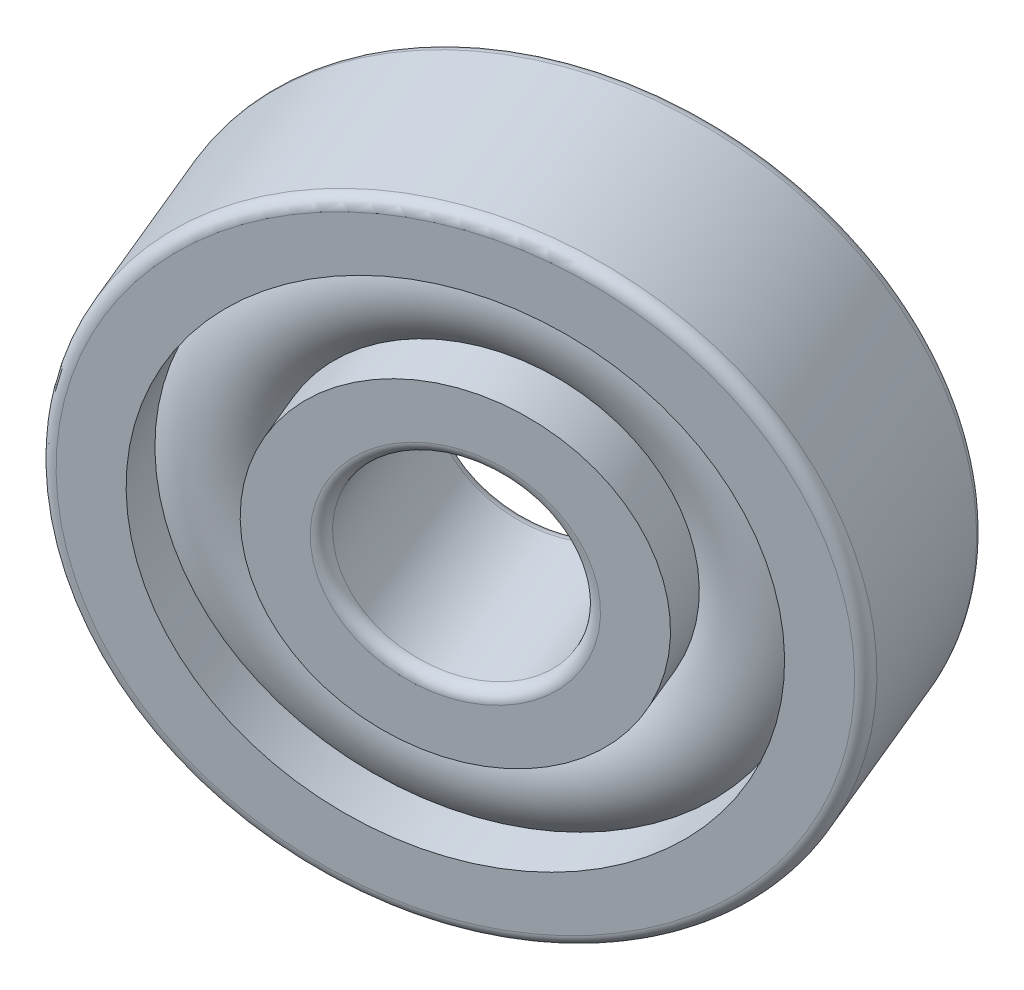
ISO-10303-21;
HEADER;
FILE_DESCRIPTION(('STEP AP214'),'2;1');
FILE_NAME('part.step','',(''),(''),'','','');
FILE_SCHEMA(('AUTOMOTIVE_DESIGN { 1 0 10303 214 1 1 1 1 }'));
ENDSEC;
DATA;
#1=APPLICATION_CONTEXT('core data for automotive mechanical design processes');
#2=APPLICATION_PROTOCOL_DEFINITION('international standard','automotive_design',2000,#1);
#3=PRODUCT_CONTEXT('',#1,'mechanical');
#4=PRODUCT('Part','Part','',(#3));
#5=PRODUCT_RELATED_PRODUCT_CATEGORY('part','',(#4));
#6=PRODUCT_DEFINITION_FORMATION('','',#4);
#7=PRODUCT_DEFINITION_CONTEXT('part definition',#1,'design');
#8=PRODUCT_DEFINITION('design','',#6,#7);
#9=PRODUCT_DEFINITION_SHAPE('','',#8);
#10=(LENGTH_UNIT() NAMED_UNIT(*) SI_UNIT(.MILLI.,.METRE.));
#11=(NAMED_UNIT(*) PLANE_ANGLE_UNIT() SI_UNIT($,.RADIAN.));
#12=(NAMED_UNIT(*) SI_UNIT($,.STERADIAN.) SOLID_ANGLE_UNIT());
#13=UNCERTAINTY_MEASURE_WITH_UNIT(LENGTH_MEASURE(1.E-05),#10,'distance_accuracy_value','');
#14=(GEOMETRIC_REPRESENTATION_CONTEXT(3) GLOBAL_UNCERTAINTY_ASSIGNED_CONTEXT((#13)) GLOBAL_UNIT_ASSIGNED_CONTEXT((#10,
#11,#12)) REPRESENTATION_CONTEXT('',''));
#15=CARTESIAN_POINT('',(0.,0.,0.));
#16=DIRECTION('',(0.,0.,1.));
#17=DIRECTION('',(1.,0.,0.));
#18=AXIS2_PLACEMENT_3D('',#15,#16,#17);
#19=CARTESIAN_POINT('',(40.2475743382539,-0.0626414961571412,-1.79860310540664));
#20=DIRECTION('',(-0.364454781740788,0.0340887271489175,-0.93059694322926));
#21=DIRECTION('',(-0.931138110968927,0.,0.364666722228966));
#22=AXIS2_PLACEMENT_3D('',#19,#20,#21);
#23=CYLINDRICAL_SURFACE('',#22,2.5);
#24=CARTESIAN_POINT('',(31.9243382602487,0.715859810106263,-23.0511107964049));
#25=DIRECTION('',(-0.364454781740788,0.0340887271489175,-0.930596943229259));
#26=DIRECTION('',(-0.888462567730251,0.286611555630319,0.358452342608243));
#27=AXIS2_PLACEMENT_3D('',#24,#25,#26);
#28=CIRCLE('',#27,2.5);
#29=CARTESIAN_POINT('',(29.7031818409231,1.43238869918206,-22.1549799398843));
#30=VERTEX_POINT('',#29);
#31=EDGE_CURVE('E69',#30,#30,#28,.F.);
#32=ORIENTED_EDGE('',*,*,#31,.F.);
#33=EDGE_LOOP('',(#32));
#34=FACE_BOUND('',#33,.T.);
#35=CARTESIAN_POINT('',(33.5279392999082,0.565869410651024,-18.9564842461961));
#36=DIRECTION('',(-0.364454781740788,0.0340887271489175,-0.930596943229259));
#37=DIRECTION('',(-0.888462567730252,0.286611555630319,0.358452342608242));
#38=AXIS2_PLACEMENT_3D('',#35,#36,#37);
#39=CIRCLE('',#38,2.5);
#40=CARTESIAN_POINT('',(31.3067828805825,1.28239829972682,-18.0603533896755));
#41=VERTEX_POINT('',#40);
#42=EDGE_CURVE('E131',#41,#41,#39,.T.);
#43=ORIENTED_EDGE('',*,*,#42,.F.);
#44=EDGE_LOOP('',(#43));
#45=FACE_BOUND('',#44,.T.);
#46=ADVANCED_FACE('F17',(#34,#45),#23,.F.);
#47=CARTESIAN_POINT('',(33.5279392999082,0.565869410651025,-18.9564842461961));
#48=DIRECTION('',(-0.364454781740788,0.0340887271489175,-0.930596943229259));
#49=DIRECTION('',(-0.888462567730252,0.286611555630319,0.358452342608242));
#50=AXIS2_PLACEMENT_3D('',#47,#48,#49);
#51=TOROIDAL_SURFACE('',#50,2.8,0.3);
#52=ORIENTED_EDGE('',*,*,#42,.T.);
#53=EDGE_LOOP('',(#52));
#54=FACE_BOUND('',#53,.T.);
#55=CARTESIAN_POINT('',(33.6372757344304,0.55564279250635,-18.6773051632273));
#56=DIRECTION('',(0.364454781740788,-0.0340887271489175,0.930596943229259));
#57=DIRECTION('',(-0.888462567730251,0.286611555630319,0.358452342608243));
#58=AXIS2_PLACEMENT_3D('',#55,#56,#57);
#59=CIRCLE('',#58,2.79999999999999);
#60=CARTESIAN_POINT('',(36.1249709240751,-0.246869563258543,-19.6809717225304));
#61=VERTEX_POINT('',#60);
#62=CARTESIAN_POINT('',(31.1495805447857,1.35815514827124,-17.6736386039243));
#63=VERTEX_POINT('',#62);
#64=EDGE_CURVE('E58',#61,#63,#59,.F.);
#65=ORIENTED_EDGE('',*,*,#64,.F.);
#66=CARTESIAN_POINT('',(33.6372757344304,0.55564279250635,-18.6773051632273));
#67=DIRECTION('',(0.364454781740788,-0.0340887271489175,0.930596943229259));
#68=DIRECTION('',(0.888462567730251,-0.28661155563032,-0.358452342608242));
#69=AXIS2_PLACEMENT_3D('',#66,#67,#68);
#70=CIRCLE('',#69,2.8);
#71=EDGE_CURVE('E56',#63,#61,#70,.F.);
#72=ORIENTED_EDGE('',*,*,#71,.F.);
#73=EDGE_LOOP('',(#65,#72));
#74=FACE_BOUND('',#73,.T.);
#75=ADVANCED_FACE('F60',(#54,#74),#51,.T.);
#76=CARTESIAN_POINT('',(31.9243382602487,0.715859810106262,-23.0511107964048));
#77=DIRECTION('',(-0.364454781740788,0.0340887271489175,-0.930596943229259));
#78=DIRECTION('',(-0.888462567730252,0.286611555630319,0.358452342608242));
#79=AXIS2_PLACEMENT_3D('',#76,#77,#78);
#80=TOROIDAL_SURFACE('',#79,2.8,0.3);
#81=CARTESIAN_POINT('',(31.8150018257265,0.726086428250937,-23.3302898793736));
#82=DIRECTION('',(-0.364454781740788,0.0340887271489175,-0.930596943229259));
#83=DIRECTION('',(-0.888462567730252,0.286611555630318,0.358452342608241));
#84=AXIS2_PLACEMENT_3D('',#81,#82,#83);
#85=CIRCLE('',#84,2.80000000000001);
#86=CARTESIAN_POINT('',(34.3026970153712,-0.0764259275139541,-24.3339564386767));
#87=VERTEX_POINT('',#86);
#88=CARTESIAN_POINT('',(29.3273066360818,1.52859878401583,-22.3266233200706));
#89=VERTEX_POINT('',#88);
#90=EDGE_CURVE('E63',#87,#89,#85,.F.);
#91=ORIENTED_EDGE('',*,*,#90,.F.);
#92=CARTESIAN_POINT('',(31.8150018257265,0.726086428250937,-23.3302898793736));
#93=DIRECTION('',(-0.364454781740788,0.0340887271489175,-0.930596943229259));
#94=DIRECTION('',(0.888462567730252,-0.286611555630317,-0.358452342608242));
#95=AXIS2_PLACEMENT_3D('',#92,#93,#94);
#96=CIRCLE('',#95,2.79999999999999);
#97=EDGE_CURVE('E107',#89,#87,#96,.F.);
#98=ORIENTED_EDGE('',*,*,#97,.F.);
#99=EDGE_LOOP('',(#91,#98));
#100=FACE_BOUND('',#99,.T.);
#101=ORIENTED_EDGE('',*,*,#31,.T.);
#102=EDGE_LOOP('',(#101));
#103=FACE_BOUND('',#102,.T.);
#104=ADVANCED_FACE('F89',(#100,#103),#80,.T.);
#105=CARTESIAN_POINT('',(34.7948726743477,4.52901970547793,-18.9851122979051));
#106=DIRECTION('',(0.364454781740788,-0.0340887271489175,0.93059694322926));
#107=DIRECTION('',(0.931138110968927,0.,-0.364666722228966));
#108=AXIS2_PLACEMENT_3D('',#105,#106,#107);
#109=PLANE('',#108);
#110=ORIENTED_EDGE('',*,*,#71,.T.);
#111=ORIENTED_EDGE('',*,*,#64,.T.);
#112=EDGE_LOOP('',(#110,#111));
#113=FACE_BOUND('',#112,.T.);
#114=CARTESIAN_POINT('',(33.6372757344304,0.55564279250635,-18.6773051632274));
#115=DIRECTION('',(-0.364454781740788,0.0340887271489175,-0.93059694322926));
#116=DIRECTION('',(-0.931138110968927,0.,0.364666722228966));
#117=AXIS2_PLACEMENT_3D('',#114,#115,#116);
#118=CIRCLE('',#117,4.15);
#119=CARTESIAN_POINT('',(29.7730525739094,0.55564279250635,-17.1639382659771));
#120=VERTEX_POINT('',#119);
#121=EDGE_CURVE('E147',#120,#120,#118,.T.);
#122=ORIENTED_EDGE('',*,*,#121,.F.);
#123=EDGE_LOOP('',(#122));
#124=FACE_BOUND('',#123,.T.);
#125=ADVANCED_FACE('F67',(#113,#124),#109,.T.);
#126=CARTESIAN_POINT('',(32.5960310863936,3.40691904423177,-23.5379669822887));
#127=DIRECTION('',(-0.364454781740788,0.0340887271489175,-0.930596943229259));
#128=DIRECTION('',(-0.931138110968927,0.,0.364666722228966));
#129=AXIS2_PLACEMENT_3D('',#126,#127,#128);
#130=PLANE('',#129);
#131=ORIENTED_EDGE('',*,*,#90,.T.);
#132=ORIENTED_EDGE('',*,*,#97,.T.);
#133=EDGE_LOOP('',(#131,#132));
#134=FACE_BOUND('',#133,.T.);
#135=CARTESIAN_POINT('',(31.8150018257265,0.726086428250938,-23.3302898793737));
#136=DIRECTION('',(-0.364454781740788,0.0340887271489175,-0.93059694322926));
#137=DIRECTION('',(-0.931138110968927,0.,0.364666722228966));
#138=AXIS2_PLACEMENT_3D('',#135,#136,#137);
#139=CIRCLE('',#138,4.15);
#140=CARTESIAN_POINT('',(27.9507786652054,0.726086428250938,-21.8169229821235));
#141=VERTEX_POINT('',#140);
#142=EDGE_CURVE('E143',#141,#141,#139,.F.);
#143=ORIENTED_EDGE('',*,*,#142,.F.);
#144=EDGE_LOOP('',(#143));
#145=FACE_BOUND('',#144,.T.);
#146=ADVANCED_FACE('F88',(#134,#145),#130,.T.);
#147=CARTESIAN_POINT('',(40.2475743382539,-0.0626414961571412,-1.79860310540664));
#148=DIRECTION('',(-0.364454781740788,0.0340887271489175,-0.93059694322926));
#149=DIRECTION('',(-0.931138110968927,0.,0.364666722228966));
#150=AXIS2_PLACEMENT_3D('',#147,#148,#149);
#151=CYLINDRICAL_SURFACE('',#150,4.15);
#152=ORIENTED_EDGE('',*,*,#121,.T.);
#153=EDGE_LOOP('',(#152));
#154=FACE_BOUND('',#153,.T.);
#155=CARTESIAN_POINT('',(33.1743588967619,0.598941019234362,-19.8593146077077));
#156=DIRECTION('',(0.364454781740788,-0.0340887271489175,0.930596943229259));
#157=DIRECTION('',(0.888462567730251,-0.286611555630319,-0.358452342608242));
#158=AXIS2_PLACEMENT_3D('',#155,#156,#157);
#159=CIRCLE('',#158,4.14999999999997);
#160=CARTESIAN_POINT('',(36.8614785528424,-0.590496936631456,-21.3468918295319));
#161=VERTEX_POINT('',#160);
#162=EDGE_CURVE('E146',#161,#161,#159,.F.);
#163=ORIENTED_EDGE('',*,*,#162,.F.);
#164=EDGE_LOOP('',(#163));
#165=FACE_BOUND('',#164,.T.);
#166=ADVANCED_FACE('F281',(#154,#165),#151,.T.);
#167=CARTESIAN_POINT('',(40.2475743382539,-0.0626414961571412,-1.79860310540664));
#168=DIRECTION('',(-0.364454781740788,0.0340887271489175,-0.93059694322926));
#169=DIRECTION('',(-0.931138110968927,0.,0.364666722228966));
#170=AXIS2_PLACEMENT_3D('',#167,#168,#169);
#171=CYLINDRICAL_SURFACE('',#170,4.15);
#172=CARTESIAN_POINT('',(32.277918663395,0.682788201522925,-22.1482804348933));
#173=DIRECTION('',(0.364454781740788,-0.0340887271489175,0.930596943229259));
#174=DIRECTION('',(0.888462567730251,-0.28661155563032,-0.358452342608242));
#175=AXIS2_PLACEMENT_3D('',#172,#173,#174);
#176=CIRCLE('',#175,4.15);
#177=CARTESIAN_POINT('',(35.9650383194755,-0.506649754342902,-23.6358576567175));
#178=VERTEX_POINT('',#177);
#179=EDGE_CURVE('E265',#178,#178,#176,.T.);
#180=ORIENTED_EDGE('',*,*,#179,.F.);
#181=EDGE_LOOP('',(#180));
#182=FACE_BOUND('',#181,.T.);
#183=ORIENTED_EDGE('',*,*,#142,.T.);
#184=EDGE_LOOP('',(#183));
#185=FACE_BOUND('',#184,.T.);
#186=ADVANCED_FACE('F260',(#182,#185),#171,.T.);
#187=CARTESIAN_POINT('',(32.7261387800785,0.640864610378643,-21.0037975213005));
#188=DIRECTION('',(0.364454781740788,-0.0340887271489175,0.930596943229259));
#189=DIRECTION('',(0.888462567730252,-0.286611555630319,-0.358452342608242));
#190=AXIS2_PLACEMENT_3D('',#187,#188,#189);
#191=TOROIDAL_SURFACE('',#190,5.25,1.65);
#192=CARTESIAN_POINT('',(33.1743588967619,0.598941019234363,-19.8593146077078));
#193=DIRECTION('',(-0.364454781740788,0.0340887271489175,-0.93059694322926));
#194=DIRECTION('',(-0.931138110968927,0.,0.364666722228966));
#195=AXIS2_PLACEMENT_3D('',#192,#193,#194);
#196=CIRCLE('',#195,6.35);
#197=CARTESIAN_POINT('',(27.2616318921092,0.598941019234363,-17.5436809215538));
#198=VERTEX_POINT('',#197);
#199=EDGE_CURVE('E264',#198,#198,#196,.F.);
#200=ORIENTED_EDGE('',*,*,#199,.T.);
#201=EDGE_LOOP('',(#200));
#202=FACE_BOUND('',#201,.T.);
#203=ORIENTED_EDGE('',*,*,#162,.T.);
#204=EDGE_LOOP('',(#203));
#205=FACE_BOUND('',#204,.T.);
#206=ADVANCED_FACE('F255',(#202,#205),#191,.T.);
#207=CARTESIAN_POINT('',(32.7261387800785,0.640864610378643,-21.0037975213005));
#208=DIRECTION('',(0.364454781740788,-0.0340887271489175,0.930596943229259));
#209=DIRECTION('',(0.888462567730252,-0.286611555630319,-0.358452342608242));
#210=AXIS2_PLACEMENT_3D('',#207,#208,#209);
#211=TOROIDAL_SURFACE('',#210,5.25,1.65);
#212=ORIENTED_EDGE('',*,*,#179,.T.);
#213=EDGE_LOOP('',(#212));
#214=FACE_BOUND('',#213,.T.);
#215=CARTESIAN_POINT('',(32.2779186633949,0.682788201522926,-22.1482804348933));
#216=DIRECTION('',(-0.364454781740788,0.0340887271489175,-0.93059694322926));
#217=DIRECTION('',(-0.931138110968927,0.,0.364666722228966));
#218=AXIS2_PLACEMENT_3D('',#215,#216,#217);
#219=CIRCLE('',#218,6.35);
#220=CARTESIAN_POINT('',(26.3651916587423,0.682788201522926,-19.8326467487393));
#221=VERTEX_POINT('',#220);
#222=EDGE_CURVE('E142',#221,#221,#219,.T.);
#223=ORIENTED_EDGE('',*,*,#222,.T.);
#224=EDGE_LOOP('',(#223));
#225=FACE_BOUND('',#224,.T.);
#226=ADVANCED_FACE('F251',(#214,#225),#211,.T.);
#227=CARTESIAN_POINT('',(40.2475743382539,-0.0626414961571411,-1.79860310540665));
#228=DIRECTION('',(-0.364454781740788,0.0340887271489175,-0.93059694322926));
#229=DIRECTION('',(-0.931138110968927,0.,0.364666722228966));
#230=AXIS2_PLACEMENT_3D('',#227,#228,#229);
#231=CYLINDRICAL_SURFACE('',#230,6.35);
#232=ORIENTED_EDGE('',*,*,#199,.F.);
#233=EDGE_LOOP('',(#232));
#234=FACE_BOUND('',#233,.T.);
#235=CARTESIAN_POINT('',(33.6372757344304,0.555642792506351,-18.6773051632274));
#236=DIRECTION('',(-0.364454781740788,0.0340887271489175,-0.93059694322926));
#237=DIRECTION('',(-0.931138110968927,0.,0.364666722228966));
#238=AXIS2_PLACEMENT_3D('',#235,#236,#237);
#239=CIRCLE('',#238,6.35);
#240=CARTESIAN_POINT('',(27.7245487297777,0.555642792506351,-16.3616714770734));
#241=VERTEX_POINT('',#240);
#242=EDGE_CURVE('E138',#241,#241,#239,.T.);
#243=ORIENTED_EDGE('',*,*,#242,.F.);
#244=EDGE_LOOP('',(#243));
#245=FACE_BOUND('',#244,.T.);
#246=ADVANCED_FACE('F254',(#234,#245),#231,.F.);
#247=CARTESIAN_POINT('',(40.2475743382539,-0.0626414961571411,-1.79860310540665));
#248=DIRECTION('',(-0.364454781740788,0.0340887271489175,-0.93059694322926));
#249=DIRECTION('',(-0.931138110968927,0.,0.364666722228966));
#250=AXIS2_PLACEMENT_3D('',#247,#248,#249);
#251=CYLINDRICAL_SURFACE('',#250,6.35);
#252=CARTESIAN_POINT('',(31.8150018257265,0.726086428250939,-23.3302898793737));
#253=DIRECTION('',(-0.364454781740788,0.0340887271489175,-0.93059694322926));
#254=DIRECTION('',(-0.931138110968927,0.,0.364666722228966));
#255=AXIS2_PLACEMENT_3D('',#252,#253,#254);
#256=CIRCLE('',#255,6.35);
#257=CARTESIAN_POINT('',(25.9022748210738,0.726086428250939,-21.0146561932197));
#258=VERTEX_POINT('',#257);
#259=EDGE_CURVE('E134',#258,#258,#256,.F.);
#260=ORIENTED_EDGE('',*,*,#259,.F.);
#261=EDGE_LOOP('',(#260));
#262=FACE_BOUND('',#261,.T.);
#263=ORIENTED_EDGE('',*,*,#222,.F.);
#264=EDGE_LOOP('',(#263));
#265=FACE_BOUND('',#264,.T.);
#266=ADVANCED_FACE('F225',(#262,#265),#251,.F.);
#267=CARTESIAN_POINT('',(35.4085385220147,6.63538818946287,-19.1482871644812));
#268=DIRECTION('',(0.364454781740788,-0.0340887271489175,0.93059694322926));
#269=DIRECTION('',(0.931138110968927,0.,-0.364666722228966));
#270=AXIS2_PLACEMENT_3D('',#267,#268,#269);
#271=PLANE('',#270);
#272=ORIENTED_EDGE('',*,*,#242,.T.);
#273=EDGE_LOOP('',(#272));
#274=FACE_BOUND('',#273,.T.);
#275=CARTESIAN_POINT('',(33.6372757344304,0.55564279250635,-18.6773051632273));
#276=DIRECTION('',(-0.364454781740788,0.0340887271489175,-0.930596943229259));
#277=DIRECTION('',(-0.888462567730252,0.286611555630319,0.358452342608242));
#278=AXIS2_PLACEMENT_3D('',#275,#276,#277);
#279=CIRCLE('',#278,7.69999999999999);
#280=CARTESIAN_POINT('',(26.7961139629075,2.76255177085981,-15.9172221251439));
#281=VERTEX_POINT('',#280);
#282=CARTESIAN_POINT('',(40.4784375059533,-1.6512661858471,-21.4373882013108));
#283=VERTEX_POINT('',#282);
#284=EDGE_CURVE('E141',#281,#283,#279,.T.);
#285=ORIENTED_EDGE('',*,*,#284,.F.);
#286=CARTESIAN_POINT('',(33.6372757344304,0.55564279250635,-18.6773051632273));
#287=DIRECTION('',(-0.364454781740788,0.0340887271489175,-0.930596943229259));
#288=DIRECTION('',(0.888462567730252,-0.286611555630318,-0.358452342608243));
#289=AXIS2_PLACEMENT_3D('',#286,#287,#288);
#290=CIRCLE('',#289,7.70000000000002);
#291=EDGE_CURVE('E137',#283,#281,#290,.T.);
#292=ORIENTED_EDGE('',*,*,#291,.F.);
#293=EDGE_LOOP('',(#285,#292));
#294=FACE_BOUND('',#293,.T.);
#295=ADVANCED_FACE('F216',(#274,#294),#271,.T.);
#296=CARTESIAN_POINT('',(33.962832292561,8.09837612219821,-23.9014019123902));
#297=DIRECTION('',(-0.364454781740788,0.0340887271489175,-0.930596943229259));
#298=DIRECTION('',(-0.931138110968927,0.,0.364666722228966));
#299=AXIS2_PLACEMENT_3D('',#296,#297,#298);
#300=PLANE('',#299);
#301=ORIENTED_EDGE('',*,*,#259,.T.);
#302=EDGE_LOOP('',(#301));
#303=FACE_BOUND('',#302,.T.);
#304=CARTESIAN_POINT('',(31.8150018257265,0.726086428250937,-23.3302898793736));
#305=DIRECTION('',(0.364454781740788,-0.0340887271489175,0.930596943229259));
#306=DIRECTION('',(0.888462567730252,-0.286611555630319,-0.358452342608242));
#307=AXIS2_PLACEMENT_3D('',#304,#305,#306);
#308=CIRCLE('',#307,7.70000000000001);
#309=CARTESIAN_POINT('',(24.9738400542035,2.9329954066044,-20.5702068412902));
#310=VERTEX_POINT('',#309);
#311=CARTESIAN_POINT('',(38.6561635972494,-1.48082255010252,-26.0903729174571));
#312=VERTEX_POINT('',#311);
#313=EDGE_CURVE('E35',#310,#312,#308,.F.);
#314=ORIENTED_EDGE('',*,*,#313,.T.);
#315=CARTESIAN_POINT('',(31.8150018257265,0.726086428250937,-23.3302898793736));
#316=DIRECTION('',(0.364454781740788,-0.0340887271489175,0.930596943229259));
#317=DIRECTION('',(-0.888462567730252,0.286611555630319,0.358452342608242));
#318=AXIS2_PLACEMENT_3D('',#315,#316,#317);
#319=CIRCLE('',#318,7.70000000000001);
#320=EDGE_CURVE('E192',#310,#312,#319,.T.);
#321=ORIENTED_EDGE('',*,*,#320,.F.);
#322=EDGE_LOOP('',(#314,#321));
#323=FACE_BOUND('',#322,.T.);
#324=ADVANCED_FACE('F170',(#303,#323),#300,.T.);
#325=CARTESIAN_POINT('',(33.5279392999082,0.565869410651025,-18.9564842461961));
#326=DIRECTION('',(-0.364454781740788,0.0340887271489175,-0.930596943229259));
#327=DIRECTION('',(-0.888462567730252,0.286611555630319,0.358452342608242));
#328=AXIS2_PLACEMENT_3D('',#325,#326,#327);
#329=TOROIDAL_SURFACE('',#328,7.7,0.3);
#330=ORIENTED_EDGE('',*,*,#284,.T.);
#331=ORIENTED_EDGE('',*,*,#291,.T.);
#332=EDGE_LOOP('',(#330,#331));
#333=FACE_BOUND('',#332,.T.);
#334=CARTESIAN_POINT('',(33.5279392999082,0.565869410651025,-18.9564842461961));
#335=DIRECTION('',(-0.364454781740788,0.0340887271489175,-0.93059694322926));
#336=DIRECTION('',(-0.931138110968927,0.,0.364666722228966));
#337=AXIS2_PLACEMENT_3D('',#334,#335,#336);
#338=CIRCLE('',#337,8.00000000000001);
#339=CARTESIAN_POINT('',(26.0788344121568,0.565869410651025,-16.0391504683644));
#340=VERTEX_POINT('',#339);
#341=EDGE_CURVE('E27',#340,#340,#338,.T.);
#342=ORIENTED_EDGE('',*,*,#341,.F.);
#343=EDGE_LOOP('',(#342));
#344=FACE_BOUND('',#343,.T.);
#345=ADVANCED_FACE('F158',(#333,#344),#329,.T.);
#346=CARTESIAN_POINT('',(31.9243382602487,0.715859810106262,-23.0511107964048));
#347=DIRECTION('',(-0.364454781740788,0.0340887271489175,-0.930596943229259));
#348=DIRECTION('',(-0.888462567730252,0.286611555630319,0.358452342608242));
#349=AXIS2_PLACEMENT_3D('',#346,#347,#348);
#350=TOROIDAL_SURFACE('',#349,7.7,0.3);
#351=ORIENTED_EDGE('',*,*,#320,.T.);
#352=ORIENTED_EDGE('',*,*,#313,.F.);
#353=EDGE_LOOP('',(#351,#352));
#354=FACE_BOUND('',#353,.T.);
#355=CARTESIAN_POINT('',(31.9243382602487,0.715859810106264,-23.0511107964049));
#356=DIRECTION('',(-0.364454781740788,0.0340887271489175,-0.93059694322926));
#357=DIRECTION('',(-0.931138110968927,0.,0.364666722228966));
#358=AXIS2_PLACEMENT_3D('',#355,#356,#357);
#359=CIRCLE('',#358,8.00000000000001);
#360=CARTESIAN_POINT('',(24.4752333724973,0.715859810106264,-20.1337770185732));
#361=VERTEX_POINT('',#360);
#362=EDGE_CURVE('E11',#361,#361,#359,.F.);
#363=ORIENTED_EDGE('',*,*,#362,.F.);
#364=EDGE_LOOP('',(#363));
#365=FACE_BOUND('',#364,.T.);
#366=ADVANCED_FACE('F169',(#354,#365),#350,.T.);
#367=CARTESIAN_POINT('',(40.2475743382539,-0.0626414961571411,-1.79860310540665));
#368=DIRECTION('',(-0.364454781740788,0.0340887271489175,-0.93059694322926));
#369=DIRECTION('',(-0.931138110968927,0.,0.364666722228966));
#370=AXIS2_PLACEMENT_3D('',#367,#368,#369);
#371=CYLINDRICAL_SURFACE('',#370,8.00000000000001);
#372=ORIENTED_EDGE('',*,*,#341,.T.);
#373=EDGE_LOOP('',(#372));
#374=FACE_BOUND('',#373,.T.);
#375=ORIENTED_EDGE('',*,*,#362,.T.);
#376=EDGE_LOOP('',(#375));
#377=FACE_BOUND('',#376,.T.);
#378=ADVANCED_FACE('F292',(#374,#377),#371,.T.);
#379=CLOSED_SHELL('',(#46,#75,#104,#125,#146,#166,#186,#206,#226,#246,#266,#295,#324,#345,#366,#378));
#380=MANIFOLD_SOLID_BREP('B1',#379);
#381=ADVANCED_BREP_SHAPE_REPRESENTATION('',(#18,#380),#14);
#382=SHAPE_DEFINITION_REPRESENTATION(#9,#381);
ENDSEC;
END-ISO-10303-21;
